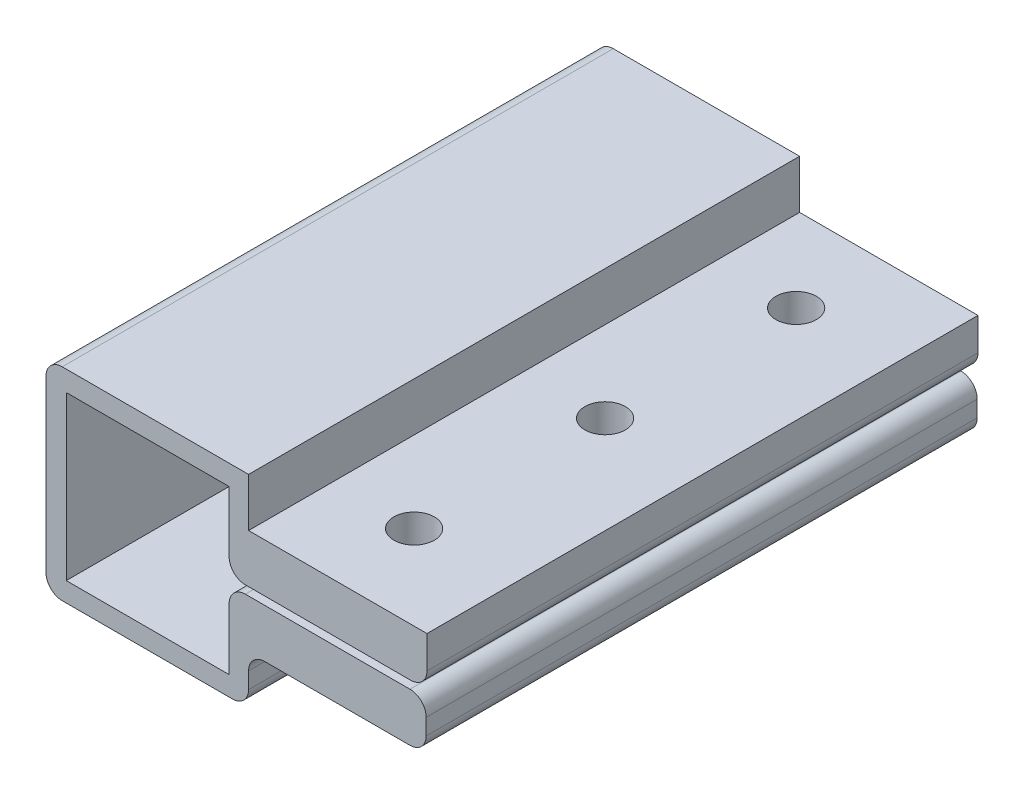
from build123d import *

# Parameters (mm, degrees)
BOSS_EXTRUDE1_DEPTH = 68.000600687
SKETCH2_R           = 2.5
CUT_EXTRUDE1_DEPTH  = 20


with BuildPart() as part:
    # Sketch1 → Boss-Extrude1 (new body)
    with BuildSketch(Plane.XY):
        with BuildLine():
            Line((-214.942156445, 9.198580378), (-192.925815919, 9.198580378))
            Line((-192.925815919, 9.198580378), (-192.925815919, 5.198580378))
            ThreePointArc((-192.925815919, 5.198580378), (-193.511602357, 3.784366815), (-194.925815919, 3.198580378))
            Line((-194.925815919, 3.198580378), (-215.342156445, 3.198580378))
            ThreePointArc((-215.342156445, 3.198580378), (-216.756370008, 3.784366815), (-217.342156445, 5.198580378))
            Line((-217.342156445, 5.198580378), (-217.342156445, 12.698580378))
            Line((-217.342156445, 12.698580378), (-237.442156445, 12.698580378))
            Line((-237.442156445, 12.698580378), (-237.442156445, -7.401419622))
            Line((-237.442156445, -7.401419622), (-217.342156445, -7.401419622))
            Line((-217.342156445, -7.401419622), (-217.342156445, 0.198580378))
            ThreePointArc((-217.342156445, 0.198580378), (-216.756370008, 1.61279394), (-215.342156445, 2.198580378))
            Line((-215.342156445, 2.198580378), (-195.025815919, 2.198580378))
            ThreePointArc((-195.025815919, 2.198580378), (-193.611602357, 1.61279394), (-193.025815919, 0.198580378))
            Line((-193.025815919, 0.198580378), (-193.025815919, -1.801419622))
            ThreePointArc((-193.025815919, -1.801419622), (-193.611602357, -3.215633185), (-195.025815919, -3.801419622))
            Line((-195.025815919, -3.801419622), (-212.942156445, -3.801419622))
            ThreePointArc((-212.942156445, -3.801419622), (-214.356370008, -4.38720606), (-214.942156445, -5.801419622))
            Line((-214.942156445, -5.801419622), (-214.942156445, -7.801419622))
            ThreePointArc((-214.942156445, -7.801419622), (-215.527942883, -9.215633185), (-216.942156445, -9.801419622))
            Line((-216.942156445, -9.801419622), (-237.942156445, -9.801419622))
            ThreePointArc((-237.942156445, -9.801419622), (-239.356370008, -9.215633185), (-239.942156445, -7.801419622))
            Line((-239.942156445, -7.801419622), (-239.942156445, 13.198580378))
            ThreePointArc((-239.942156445, 13.198580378), (-239.356370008, 14.61279394), (-237.942156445, 15.198580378))
            Line((-237.942156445, 15.198580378), (-214.942156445, 15.198580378))
            Line((-214.942156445, 15.198580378), (-214.942156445, 9.198580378))
        make_face()
    extrude(amount=-BOSS_EXTRUDE1_DEPTH)

    # Sketch2 → Cut-Extrude1 (cut)
    with BuildSketch(Plane(origin=(0, 9.198580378, 0), x_dir=(-1, 0, 0), z_dir=(0, 1, 0))):
        with Locations(Location((204.942156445, -57.575022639, 0), (0, 0, 90))):
            Circle(SKETCH2_R)
        with Locations(Location((204.942156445, -34.000300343, 0), (0, 0, 90))):
            Circle(SKETCH2_R)
        with Locations(Location((204.942156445, -10.425578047, 0), (0, 0, 90))):
            Circle(SKETCH2_R)
    extrude(amount=-CUT_EXTRUDE1_DEPTH, mode=Mode.SUBTRACT)


solid = part.part
